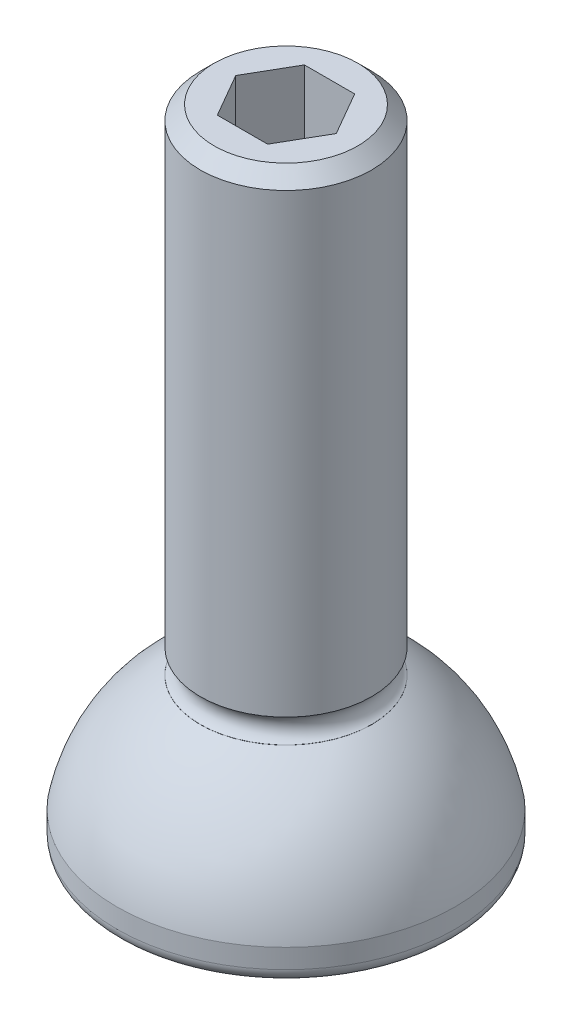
ISO-10303-21;
HEADER;
FILE_DESCRIPTION(('STEP AP214'),'2;1');
FILE_NAME('part.step','',(''),(''),'','','');
FILE_SCHEMA(('AUTOMOTIVE_DESIGN { 1 0 10303 214 1 1 1 1 }'));
ENDSEC;
DATA;
#1=APPLICATION_CONTEXT('core data for automotive mechanical design processes');
#2=APPLICATION_PROTOCOL_DEFINITION('international standard','automotive_design',2000,#1);
#3=PRODUCT_CONTEXT('',#1,'mechanical');
#4=PRODUCT('Part','Part','',(#3));
#5=PRODUCT_RELATED_PRODUCT_CATEGORY('part','',(#4));
#6=PRODUCT_DEFINITION_FORMATION('','',#4);
#7=PRODUCT_DEFINITION_CONTEXT('part definition',#1,'design');
#8=PRODUCT_DEFINITION('design','',#6,#7);
#9=PRODUCT_DEFINITION_SHAPE('','',#8);
#10=(LENGTH_UNIT() NAMED_UNIT(*) SI_UNIT(.MILLI.,.METRE.));
#11=(NAMED_UNIT(*) PLANE_ANGLE_UNIT() SI_UNIT($,.RADIAN.));
#12=(NAMED_UNIT(*) SI_UNIT($,.STERADIAN.) SOLID_ANGLE_UNIT());
#13=UNCERTAINTY_MEASURE_WITH_UNIT(LENGTH_MEASURE(1.E-05),#10,'distance_accuracy_value','');
#14=(GEOMETRIC_REPRESENTATION_CONTEXT(3) GLOBAL_UNCERTAINTY_ASSIGNED_CONTEXT((#13)) GLOBAL_UNIT_ASSIGNED_CONTEXT((#10,
#11,#12)) REPRESENTATION_CONTEXT('',''));
#15=CARTESIAN_POINT('',(0.,0.,0.));
#16=DIRECTION('',(0.,0.,1.));
#17=DIRECTION('',(1.,0.,0.));
#18=AXIS2_PLACEMENT_3D('',#15,#16,#17);
#19=CARTESIAN_POINT('',(3.49148336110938E-12,-1000.,0.));
#20=DIRECTION('',(0.,-1.,0.));
#21=DIRECTION('',(1.,0.,0.));
#22=AXIS2_PLACEMENT_3D('',#19,#20,#21);
#23=CYLINDRICAL_SURFACE('',#22,4.69900000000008);
#24=CARTESIAN_POINT('',(0.,9.52451135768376,0.));
#25=DIRECTION('',(0.,-1.,0.));
#26=DIRECTION('',(1.,0.,0.));
#27=AXIS2_PLACEMENT_3D('',#24,#25,#26);
#28=CIRCLE('',#27,4.69900000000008);
#29=CARTESIAN_POINT('',(4.69900000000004,9.52451135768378,0.));
#30=VERTEX_POINT('',#29);
#31=EDGE_CURVE('E194',#30,#30,#28,.T.);
#32=ORIENTED_EDGE('',*,*,#31,.F.);
#33=EDGE_LOOP('',(#32));
#34=FACE_BOUND('',#33,.T.);
#35=CARTESIAN_POINT('',(-1.20609801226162E-13,34.5439999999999,0.));
#36=DIRECTION('',(0.,1.,0.));
#37=DIRECTION('',(-1.,0.,0.));
#38=AXIS2_PLACEMENT_3D('',#35,#36,#37);
#39=CIRCLE('',#38,4.69900000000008);
#40=CARTESIAN_POINT('',(-4.6990000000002,34.5439999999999,0.));
#41=VERTEX_POINT('',#40);
#42=EDGE_CURVE('E182',#41,#41,#39,.F.);
#43=ORIENTED_EDGE('',*,*,#42,.T.);
#44=EDGE_LOOP('',(#43));
#45=FACE_BOUND('',#44,.T.);
#46=ADVANCED_FACE('F32',(#34,#45),#23,.T.);
#47=CARTESIAN_POINT('',(4.699,35.306,0.));
#48=DIRECTION('',(0.,1.,0.));
#49=DIRECTION('',(-1.,0.,0.));
#50=AXIS2_PLACEMENT_3D('',#47,#48,#49);
#51=PLANE('',#50);
#52=DIRECTION('',(1.,0.,0.));
#53=VECTOR('',#52,1.);
#54=CARTESIAN_POINT('',(-1.37848150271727,35.306,2.3876));
#55=LINE('',#54,#53);
#56=CARTESIAN_POINT('',(-1.37848150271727,35.306,2.3876));
#57=VERTEX_POINT('',#56);
#58=CARTESIAN_POINT('',(1.37848150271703,35.306,2.3876));
#59=VERTEX_POINT('',#58);
#60=EDGE_CURVE('E155',#57,#59,#55,.T.);
#61=ORIENTED_EDGE('',*,*,#60,.F.);
#62=DIRECTION('',(0.5,0.,0.866025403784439));
#63=VECTOR('',#62,1.);
#64=CARTESIAN_POINT('',(-2.75696300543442,35.306,0.));
#65=LINE('',#64,#63);
#66=CARTESIAN_POINT('',(-2.75696300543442,35.306,0.));
#67=VERTEX_POINT('',#66);
#68=EDGE_CURVE('E152',#67,#57,#65,.T.);
#69=ORIENTED_EDGE('',*,*,#68,.F.);
#70=DIRECTION('',(-0.5,0.,0.866025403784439));
#71=VECTOR('',#70,1.);
#72=CARTESIAN_POINT('',(-1.37848150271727,35.306,-2.3876));
#73=LINE('',#72,#71);
#74=CARTESIAN_POINT('',(-1.37848150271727,35.306,-2.3876));
#75=VERTEX_POINT('',#74);
#76=EDGE_CURVE('E149',#75,#67,#73,.T.);
#77=ORIENTED_EDGE('',*,*,#76,.F.);
#78=DIRECTION('',(-1.,0.,0.));
#79=VECTOR('',#78,1.);
#80=CARTESIAN_POINT('',(1.37848150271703,35.306,-2.3876));
#81=LINE('',#80,#79);
#82=CARTESIAN_POINT('',(1.37848150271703,35.306,-2.3876));
#83=VERTEX_POINT('',#82);
#84=EDGE_CURVE('E147',#83,#75,#81,.T.);
#85=ORIENTED_EDGE('',*,*,#84,.F.);
#86=DIRECTION('',(-0.5,0.,-0.866025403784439));
#87=VECTOR('',#86,1.);
#88=CARTESIAN_POINT('',(2.75696300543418,35.306,0.));
#89=LINE('',#88,#87);
#90=CARTESIAN_POINT('',(2.75696300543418,35.306,0.));
#91=VERTEX_POINT('',#90);
#92=EDGE_CURVE('E122',#91,#83,#89,.T.);
#93=ORIENTED_EDGE('',*,*,#92,.F.);
#94=DIRECTION('',(0.5,0.,-0.866025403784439));
#95=VECTOR('',#94,1.);
#96=CARTESIAN_POINT('',(1.37848150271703,35.306,2.3876));
#97=LINE('',#96,#95);
#98=EDGE_CURVE('E115',#59,#91,#97,.T.);
#99=ORIENTED_EDGE('',*,*,#98,.F.);
#100=EDGE_LOOP('',(#61,#69,#77,#85,#93,#99));
#101=FACE_BOUND('',#100,.T.);
#102=CARTESIAN_POINT('',(-1.23270311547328E-13,35.306,0.));
#103=DIRECTION('',(0.,1.,0.));
#104=DIRECTION('',(-1.,0.,0.));
#105=AXIS2_PLACEMENT_3D('',#102,#103,#104);
#106=CIRCLE('',#105,3.9370000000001);
#107=CARTESIAN_POINT('',(-3.93700000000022,35.306,0.));
#108=VERTEX_POINT('',#107);
#109=EDGE_CURVE('E185',#108,#108,#106,.T.);
#110=ORIENTED_EDGE('',*,*,#109,.T.);
#111=EDGE_LOOP('',(#110));
#112=FACE_BOUND('',#111,.T.);
#113=ADVANCED_FACE('F226',(#101,#112),#51,.T.);
#114=CARTESIAN_POINT('',(-1.20609801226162E-13,34.5439999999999,0.));
#115=DIRECTION('',(0.,-1.,0.));
#116=DIRECTION('',(1.,0.,0.));
#117=AXIS2_PLACEMENT_3D('',#114,#115,#116);
#118=CONICAL_SURFACE('',#117,4.69900000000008,0.785398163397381);
#119=ORIENTED_EDGE('',*,*,#109,.F.);
#120=EDGE_LOOP('',(#119));
#121=FACE_BOUND('',#120,.T.);
#122=ORIENTED_EDGE('',*,*,#42,.F.);
#123=EDGE_LOOP('',(#122));
#124=FACE_BOUND('',#123,.T.);
#125=ADVANCED_FACE('F231',(#121,#124),#118,.T.);
#126=CARTESIAN_POINT('',(2.7569630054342,30.48,0.));
#127=DIRECTION('',(0.866025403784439,0.,-0.5));
#128=DIRECTION('',(-0.5,0.,-0.866025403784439));
#129=AXIS2_PLACEMENT_3D('',#126,#127,#128);
#130=PLANE('',#129);
#131=ORIENTED_EDGE('',*,*,#92,.T.);
#132=DIRECTION('',(0.,1.,0.));
#133=VECTOR('',#132,1.);
#134=CARTESIAN_POINT('',(1.37848150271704,30.48,-2.3876));
#135=LINE('',#134,#133);
#136=CARTESIAN_POINT('',(1.37848150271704,30.48,-2.3876));
#137=VERTEX_POINT('',#136);
#138=EDGE_CURVE('E119',#137,#83,#135,.T.);
#139=ORIENTED_EDGE('',*,*,#138,.F.);
#140=DIRECTION('',(-0.5,0.,-0.866025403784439));
#141=VECTOR('',#140,1.);
#142=CARTESIAN_POINT('',(2.7569630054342,30.48,0.));
#143=LINE('',#142,#141);
#144=CARTESIAN_POINT('',(2.06772225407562,30.48,-1.19380000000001));
#145=VERTEX_POINT('',#144);
#146=EDGE_CURVE('E105',#145,#137,#143,.T.);
#147=ORIENTED_EDGE('',*,*,#146,.F.);
#148=CARTESIAN_POINT('',(2.7569630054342,30.48,0.));
#149=VERTEX_POINT('',#148);
#150=EDGE_CURVE('E114',#149,#145,#143,.T.);
#151=ORIENTED_EDGE('',*,*,#150,.F.);
#152=DIRECTION('',(0.,1.,0.));
#153=VECTOR('',#152,1.);
#154=CARTESIAN_POINT('',(2.7569630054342,30.48,0.));
#155=LINE('',#154,#153);
#156=EDGE_CURVE('E160',#149,#91,#155,.T.);
#157=ORIENTED_EDGE('',*,*,#156,.T.);
#158=EDGE_LOOP('',(#131,#139,#147,#151,#157));
#159=FACE_BOUND('',#158,.T.);
#160=ADVANCED_FACE('F120',(#159),#130,.F.);
#161=CARTESIAN_POINT('',(1.37848150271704,30.48,2.3876));
#162=DIRECTION('',(0.866025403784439,0.,0.5));
#163=DIRECTION('',(0.5,0.,-0.866025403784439));
#164=AXIS2_PLACEMENT_3D('',#161,#162,#163);
#165=PLANE('',#164);
#166=ORIENTED_EDGE('',*,*,#98,.T.);
#167=ORIENTED_EDGE('',*,*,#156,.F.);
#168=DIRECTION('',(0.5,0.,-0.866025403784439));
#169=VECTOR('',#168,1.);
#170=CARTESIAN_POINT('',(1.37848150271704,30.48,2.3876));
#171=LINE('',#170,#169);
#172=CARTESIAN_POINT('',(2.06772225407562,30.48,1.19380000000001));
#173=VERTEX_POINT('',#172);
#174=EDGE_CURVE('E143',#173,#149,#171,.T.);
#175=ORIENTED_EDGE('',*,*,#174,.F.);
#176=CARTESIAN_POINT('',(1.37848150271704,30.48,2.3876));
#177=VERTEX_POINT('',#176);
#178=EDGE_CURVE('E125',#177,#173,#171,.T.);
#179=ORIENTED_EDGE('',*,*,#178,.F.);
#180=DIRECTION('',(0.,1.,0.));
#181=VECTOR('',#180,1.);
#182=CARTESIAN_POINT('',(1.37848150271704,30.48,2.3876));
#183=LINE('',#182,#181);
#184=EDGE_CURVE('E163',#177,#59,#183,.T.);
#185=ORIENTED_EDGE('',*,*,#184,.T.);
#186=EDGE_LOOP('',(#166,#167,#175,#179,#185));
#187=FACE_BOUND('',#186,.T.);
#188=ADVANCED_FACE('F246',(#187),#165,.F.);
#189=CARTESIAN_POINT('',(-1.37848150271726,30.48,2.3876));
#190=DIRECTION('',(0.,0.,1.));
#191=DIRECTION('',(1.,0.,0.));
#192=AXIS2_PLACEMENT_3D('',#189,#190,#191);
#193=PLANE('',#192);
#194=ORIENTED_EDGE('',*,*,#60,.T.);
#195=ORIENTED_EDGE('',*,*,#184,.F.);
#196=DIRECTION('',(1.,0.,0.));
#197=VECTOR('',#196,1.);
#198=CARTESIAN_POINT('',(-1.37848150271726,30.48,2.3876));
#199=LINE('',#198,#197);
#200=CARTESIAN_POINT('',(-1.20609801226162E-13,30.48,2.3876));
#201=VERTEX_POINT('',#200);
#202=EDGE_CURVE('E139',#201,#177,#199,.T.);
#203=ORIENTED_EDGE('',*,*,#202,.F.);
#204=CARTESIAN_POINT('',(-1.37848150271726,30.48,2.3876));
#205=VERTEX_POINT('',#204);
#206=EDGE_CURVE('E140',#205,#201,#199,.T.);
#207=ORIENTED_EDGE('',*,*,#206,.F.);
#208=DIRECTION('',(0.,1.,0.));
#209=VECTOR('',#208,1.);
#210=CARTESIAN_POINT('',(-1.37848150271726,30.48,2.3876));
#211=LINE('',#210,#209);
#212=EDGE_CURVE('E166',#205,#57,#211,.T.);
#213=ORIENTED_EDGE('',*,*,#212,.T.);
#214=EDGE_LOOP('',(#194,#195,#203,#207,#213));
#215=FACE_BOUND('',#214,.T.);
#216=ADVANCED_FACE('F257',(#215),#193,.F.);
#217=CARTESIAN_POINT('',(-2.75696300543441,30.48,0.));
#218=DIRECTION('',(-0.866025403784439,0.,0.5));
#219=DIRECTION('',(0.5,0.,0.866025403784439));
#220=AXIS2_PLACEMENT_3D('',#217,#218,#219);
#221=PLANE('',#220);
#222=ORIENTED_EDGE('',*,*,#68,.T.);
#223=ORIENTED_EDGE('',*,*,#212,.F.);
#224=DIRECTION('',(0.5,0.,0.866025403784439));
#225=VECTOR('',#224,1.);
#226=CARTESIAN_POINT('',(-2.75696300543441,30.48,0.));
#227=LINE('',#226,#225);
#228=CARTESIAN_POINT('',(-2.06772225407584,30.48,1.19379999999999));
#229=VERTEX_POINT('',#228);
#230=EDGE_CURVE('E137',#229,#205,#227,.T.);
#231=ORIENTED_EDGE('',*,*,#230,.F.);
#232=CARTESIAN_POINT('',(-2.75696300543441,30.48,0.));
#233=VERTEX_POINT('',#232);
#234=EDGE_CURVE('E50',#233,#229,#227,.T.);
#235=ORIENTED_EDGE('',*,*,#234,.F.);
#236=DIRECTION('',(0.,1.,0.));
#237=VECTOR('',#236,1.);
#238=CARTESIAN_POINT('',(-2.75696300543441,30.48,0.));
#239=LINE('',#238,#237);
#240=EDGE_CURVE('E169',#233,#67,#239,.T.);
#241=ORIENTED_EDGE('',*,*,#240,.T.);
#242=EDGE_LOOP('',(#222,#223,#231,#235,#241));
#243=FACE_BOUND('',#242,.T.);
#244=ADVANCED_FACE('F253',(#243),#221,.F.);
#245=CARTESIAN_POINT('',(-1.37848150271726,30.48,-2.3876));
#246=DIRECTION('',(-0.866025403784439,0.,-0.5));
#247=DIRECTION('',(-0.5,0.,0.866025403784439));
#248=AXIS2_PLACEMENT_3D('',#245,#246,#247);
#249=PLANE('',#248);
#250=ORIENTED_EDGE('',*,*,#76,.T.);
#251=ORIENTED_EDGE('',*,*,#240,.F.);
#252=DIRECTION('',(-0.5,0.,0.866025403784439));
#253=VECTOR('',#252,1.);
#254=CARTESIAN_POINT('',(-1.37848150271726,30.48,-2.3876));
#255=LINE('',#254,#253);
#256=CARTESIAN_POINT('',(-2.06772225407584,30.48,-1.19379999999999));
#257=VERTEX_POINT('',#256);
#258=EDGE_CURVE('E131',#257,#233,#255,.T.);
#259=ORIENTED_EDGE('',*,*,#258,.F.);
#260=CARTESIAN_POINT('',(-1.37848150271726,30.48,-2.3876));
#261=VERTEX_POINT('',#260);
#262=EDGE_CURVE('E133',#261,#257,#255,.T.);
#263=ORIENTED_EDGE('',*,*,#262,.F.);
#264=DIRECTION('',(0.,1.,0.));
#265=VECTOR('',#264,1.);
#266=CARTESIAN_POINT('',(-1.37848150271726,30.48,-2.3876));
#267=LINE('',#266,#265);
#268=EDGE_CURVE('E124',#261,#75,#267,.T.);
#269=ORIENTED_EDGE('',*,*,#268,.T.);
#270=EDGE_LOOP('',(#250,#251,#259,#263,#269));
#271=FACE_BOUND('',#270,.T.);
#272=ADVANCED_FACE('F250',(#271),#249,.F.);
#273=CARTESIAN_POINT('',(1.37848150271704,30.48,-2.3876));
#274=DIRECTION('',(0.,0.,-1.));
#275=DIRECTION('',(-1.,0.,0.));
#276=AXIS2_PLACEMENT_3D('',#273,#274,#275);
#277=PLANE('',#276);
#278=ORIENTED_EDGE('',*,*,#84,.T.);
#279=ORIENTED_EDGE('',*,*,#268,.F.);
#280=DIRECTION('',(-1.,0.,0.));
#281=VECTOR('',#280,1.);
#282=CARTESIAN_POINT('',(1.37848150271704,30.48,-2.3876));
#283=LINE('',#282,#281);
#284=CARTESIAN_POINT('',(-1.21360958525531E-13,30.48,-2.3876));
#285=VERTEX_POINT('',#284);
#286=EDGE_CURVE('E130',#285,#261,#283,.T.);
#287=ORIENTED_EDGE('',*,*,#286,.F.);
#288=EDGE_CURVE('E109',#137,#285,#283,.T.);
#289=ORIENTED_EDGE('',*,*,#288,.F.);
#290=ORIENTED_EDGE('',*,*,#138,.T.);
#291=EDGE_LOOP('',(#278,#279,#287,#289,#290));
#292=FACE_BOUND('',#291,.T.);
#293=ADVANCED_FACE('F128',(#292),#277,.F.);
#294=CARTESIAN_POINT('',(1.37848150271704,30.48,-2.3876));
#295=DIRECTION('',(0.,1.,0.));
#296=DIRECTION('',(-1.,0.,0.));
#297=AXIS2_PLACEMENT_3D('',#294,#295,#296);
#298=PLANE('',#297);
#299=CARTESIAN_POINT('',(-1.20609801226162E-13,30.48,0.));
#300=DIRECTION('',(0.,1.,0.));
#301=DIRECTION('',(-1.,0.,0.));
#302=AXIS2_PLACEMENT_3D('',#299,#300,#301);
#303=CIRCLE('',#302,2.3876);
#304=EDGE_CURVE('E11',#257,#285,#303,.F.);
#305=ORIENTED_EDGE('',*,*,#304,.T.);
#306=ORIENTED_EDGE('',*,*,#286,.T.);
#307=ORIENTED_EDGE('',*,*,#262,.T.);
#308=EDGE_LOOP('',(#305,#306,#307));
#309=FACE_BOUND('',#308,.T.);
#310=ADVANCED_FACE('F249',(#309),#298,.T.);
#311=EDGE_CURVE('E41',#285,#145,#303,.F.);
#312=ORIENTED_EDGE('',*,*,#311,.T.);
#313=ORIENTED_EDGE('',*,*,#146,.T.);
#314=ORIENTED_EDGE('',*,*,#288,.T.);
#315=EDGE_LOOP('',(#312,#313,#314));
#316=FACE_BOUND('',#315,.T.);
#317=ADVANCED_FACE('F107',(#316),#298,.T.);
#318=EDGE_CURVE('E431',#145,#173,#303,.F.);
#319=ORIENTED_EDGE('',*,*,#318,.T.);
#320=ORIENTED_EDGE('',*,*,#174,.T.);
#321=ORIENTED_EDGE('',*,*,#150,.T.);
#322=EDGE_LOOP('',(#319,#320,#321));
#323=FACE_BOUND('',#322,.T.);
#324=ADVANCED_FACE('F320',(#323),#298,.T.);
#325=EDGE_CURVE('E432',#173,#201,#303,.F.);
#326=ORIENTED_EDGE('',*,*,#325,.T.);
#327=ORIENTED_EDGE('',*,*,#202,.T.);
#328=ORIENTED_EDGE('',*,*,#178,.T.);
#329=EDGE_LOOP('',(#326,#327,#328));
#330=FACE_BOUND('',#329,.T.);
#331=ADVANCED_FACE('F326',(#330),#298,.T.);
#332=EDGE_CURVE('E193',#201,#229,#303,.F.);
#333=ORIENTED_EDGE('',*,*,#332,.T.);
#334=ORIENTED_EDGE('',*,*,#230,.T.);
#335=ORIENTED_EDGE('',*,*,#206,.T.);
#336=EDGE_LOOP('',(#333,#334,#335));
#337=FACE_BOUND('',#336,.T.);
#338=ADVANCED_FACE('F333',(#337),#298,.T.);
#339=EDGE_CURVE('E43',#229,#257,#303,.F.);
#340=ORIENTED_EDGE('',*,*,#339,.T.);
#341=ORIENTED_EDGE('',*,*,#258,.T.);
#342=ORIENTED_EDGE('',*,*,#234,.T.);
#343=EDGE_LOOP('',(#340,#341,#342));
#344=FACE_BOUND('',#343,.T.);
#345=ADVANCED_FACE('F240',(#344),#298,.T.);
#346=CARTESIAN_POINT('',(-1.20609801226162E-13,28.956,0.));
#347=DIRECTION('',(0.,1.,0.));
#348=DIRECTION('',(0.,0.,1.));
#349=AXIS2_PLACEMENT_3D('',#346,#347,#348);
#350=CONICAL_SURFACE('',#349,2.3876,1.02974425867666);
#351=CARTESIAN_POINT('',(-1.20597417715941E-13,27.5213851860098,0.));
#352=VERTEX_POINT('',#351);
#353=VERTEX_LOOP('',#352);
#354=FACE_BOUND('',#353,.T.);
#355=CARTESIAN_POINT('',(-1.20609801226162E-13,28.956,0.));
#356=DIRECTION('',(0.,1.,0.));
#357=DIRECTION('',(0.,0.,1.));
#358=AXIS2_PLACEMENT_3D('',#355,#356,#357);
#359=CIRCLE('',#358,2.3876);
#360=CARTESIAN_POINT('',(-1.20609801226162E-13,28.956,2.3876));
#361=VERTEX_POINT('',#360);
#362=EDGE_CURVE('E162',#361,#361,#359,.T.);
#363=ORIENTED_EDGE('',*,*,#362,.T.);
#364=EDGE_LOOP('',(#363));
#365=FACE_BOUND('',#364,.T.);
#366=ADVANCED_FACE('F236',(#354,#365),#350,.F.);
#367=CARTESIAN_POINT('',(-1.20609801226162E-13,35.306,0.));
#368=DIRECTION('',(0.,1.,0.));
#369=DIRECTION('',(0.,0.,1.));
#370=AXIS2_PLACEMENT_3D('',#367,#368,#369);
#371=CYLINDRICAL_SURFACE('',#370,2.3876);
#372=ORIENTED_EDGE('',*,*,#362,.F.);
#373=EDGE_LOOP('',(#372));
#374=FACE_BOUND('',#373,.T.);
#375=ORIENTED_EDGE('',*,*,#304,.F.);
#376=ORIENTED_EDGE('',*,*,#339,.F.);
#377=ORIENTED_EDGE('',*,*,#332,.F.);
#378=ORIENTED_EDGE('',*,*,#325,.F.);
#379=ORIENTED_EDGE('',*,*,#318,.F.);
#380=ORIENTED_EDGE('',*,*,#311,.F.);
#381=EDGE_LOOP('',(#375,#376,#377,#378,#379,#380));
#382=FACE_BOUND('',#381,.T.);
#383=ADVANCED_FACE('F239',(#374,#382),#371,.F.);
#384=CARTESIAN_POINT('',(0.,8.8646,0.));
#385=DIRECTION('',(0.,-1.,0.));
#386=DIRECTION('',(1.,0.,0.));
#387=AXIS2_PLACEMENT_3D('',#384,#385,#386);
#388=TOROIDAL_SURFACE('',#387,5.08000000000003,0.761999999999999);
#389=CARTESIAN_POINT('',(0.,8.20468864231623,0.));
#390=DIRECTION('',(0.,1.,0.));
#391=DIRECTION('',(-1.,0.,0.));
#392=AXIS2_PLACEMENT_3D('',#389,#390,#391);
#393=CIRCLE('',#392,4.69900000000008);
#394=CARTESIAN_POINT('',(-4.6990000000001,8.20468864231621,0.));
#395=VERTEX_POINT('',#394);
#396=EDGE_CURVE('E36',#395,#395,#393,.T.);
#397=ORIENTED_EDGE('',*,*,#396,.T.);
#398=EDGE_LOOP('',(#397));
#399=FACE_BOUND('',#398,.T.);
#400=ORIENTED_EDGE('',*,*,#31,.T.);
#401=EDGE_LOOP('',(#400));
#402=FACE_BOUND('',#401,.T.);
#403=ADVANCED_FACE('F201',(#399,#402),#388,.F.);
#404=CARTESIAN_POINT('',(0.,0.,0.));
#405=DIRECTION('',(0.,-1.,0.));
#406=DIRECTION('',(1.,0.,0.));
#407=AXIS2_PLACEMENT_3D('',#404,#405,#406);
#408=PLANE('',#407);
#409=CARTESIAN_POINT('',(0.,0.,0.));
#410=DIRECTION('',(0.,-1.,0.));
#411=DIRECTION('',(1.,0.,0.));
#412=AXIS2_PLACEMENT_3D('',#409,#410,#411);
#413=CIRCLE('',#412,8.509);
#414=CARTESIAN_POINT('',(8.509,0.,0.));
#415=VERTEX_POINT('',#414);
#416=EDGE_CURVE('E188',#415,#415,#413,.T.);
#417=ORIENTED_EDGE('',*,*,#416,.T.);
#418=EDGE_LOOP('',(#417));
#419=FACE_BOUND('',#418,.T.);
#420=ADVANCED_FACE('F222',(#419),#408,.T.);
#421=CARTESIAN_POINT('',(0.,0.761999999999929,0.));
#422=DIRECTION('',(0.,-1.,0.));
#423=DIRECTION('',(1.,0.,0.));
#424=AXIS2_PLACEMENT_3D('',#421,#422,#423);
#425=TOROIDAL_SURFACE('',#424,8.509,0.762);
#426=CARTESIAN_POINT('',(0.,0.761999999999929,0.));
#427=DIRECTION('',(0.,-1.,0.));
#428=DIRECTION('',(1.,0.,0.));
#429=AXIS2_PLACEMENT_3D('',#426,#427,#428);
#430=CIRCLE('',#429,9.271);
#431=CARTESIAN_POINT('',(9.271,0.761999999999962,0.));
#432=VERTEX_POINT('',#431);
#433=EDGE_CURVE('E191',#432,#432,#430,.F.);
#434=ORIENTED_EDGE('',*,*,#433,.F.);
#435=EDGE_LOOP('',(#434));
#436=FACE_BOUND('',#435,.T.);
#437=ORIENTED_EDGE('',*,*,#416,.F.);
#438=EDGE_LOOP('',(#437));
#439=FACE_BOUND('',#438,.T.);
#440=ADVANCED_FACE('F34',(#436,#439),#425,.T.);
#441=CARTESIAN_POINT('',(3.49148336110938E-12,-1000.,0.));
#442=DIRECTION('',(0.,-1.,0.));
#443=DIRECTION('',(1.,0.,0.));
#444=AXIS2_PLACEMENT_3D('',#441,#442,#443);
#445=CYLINDRICAL_SURFACE('',#444,9.271);
#446=ORIENTED_EDGE('',*,*,#433,.T.);
#447=EDGE_LOOP('',(#446));
#448=FACE_BOUND('',#447,.T.);
#449=CARTESIAN_POINT('',(0.,1.82438494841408,0.));
#450=DIRECTION('',(0.,-1.,0.));
#451=DIRECTION('',(1.,0.,0.));
#452=AXIS2_PLACEMENT_3D('',#449,#450,#451);
#453=CIRCLE('',#452,9.271);
#454=CARTESIAN_POINT('',(9.271,1.82438494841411,0.));
#455=VERTEX_POINT('',#454);
#456=EDGE_CURVE('E179',#455,#455,#453,.T.);
#457=ORIENTED_EDGE('',*,*,#456,.T.);
#458=EDGE_LOOP('',(#457));
#459=FACE_BOUND('',#458,.T.);
#460=ADVANCED_FACE('F212',(#448,#459),#445,.T.);
#461=CARTESIAN_POINT('',(0.,0.,0.));
#462=DIRECTION('',(0.,-1.,0.));
#463=DIRECTION('',(1.,0.,0.));
#464=AXIS2_PLACEMENT_3D('',#461,#462,#463);
#465=SPHERICAL_SURFACE('',#464,9.4488);
#466=CARTESIAN_POINT('',(0.,8.19751306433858,0.));
#467=DIRECTION('',(0.,-1.,0.));
#468=DIRECTION('',(1.,0.,0.));
#469=AXIS2_PLACEMENT_3D('',#466,#467,#468);
#470=CIRCLE('',#469,4.69900000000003);
#471=CARTESIAN_POINT('',(4.69899999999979,8.1975130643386,0.));
#472=VERTEX_POINT('',#471);
#473=EDGE_CURVE('E176',#472,#472,#470,.T.);
#474=CARTESIAN_POINT('',(4.69899999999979,8.1975130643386,0.));
#475=CARTESIAN_POINT('',(4.77209442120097,8.15561402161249,0.));
#476=CARTESIAN_POINT('',(4.84462814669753,8.11273685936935,0.));
#477=CARTESIAN_POINT('',(4.98852296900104,8.025058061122,0.));
#478=CARTESIAN_POINT('',(5.05988406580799,7.98025642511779,0.));
#479=CARTESIAN_POINT('',(5.20138239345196,7.88876044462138,0.));
#480=CARTESIAN_POINT('',(5.27151962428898,7.84206610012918,0.));
#481=CARTESIAN_POINT('',(5.4105200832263,7.74681819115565,0.));
#482=CARTESIAN_POINT('',(5.4793833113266,7.69826462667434,0.));
#483=CARTESIAN_POINT('',(5.61578647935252,7.59933299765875,0.));
#484=CARTESIAN_POINT('',(5.68332641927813,7.54895493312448,0.));
#485=CARTESIAN_POINT('',(5.81703468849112,7.44641035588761,0.));
#486=CARTESIAN_POINT('',(5.8832030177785,7.39424384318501,0.));
#487=CARTESIAN_POINT('',(6.01412072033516,7.28815969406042,0.));
#488=CARTESIAN_POINT('',(6.07887009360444,7.23424205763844,0.));
#489=CARTESIAN_POINT('',(6.20690355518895,7.12469424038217,0.));
#490=CARTESIAN_POINT('',(6.27018764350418,7.06906405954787,0.));
#491=CARTESIAN_POINT('',(6.39524525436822,6.95613095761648,0.));
#492=CARTESIAN_POINT('',(6.45701877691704,6.89882803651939,0.));
#493=CARTESIAN_POINT('',(6.57901105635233,6.7825904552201,0.));
#494=CARTESIAN_POINT('',(6.63922981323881,6.7236557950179,0.));
#495=CARTESIAN_POINT('',(6.75806947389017,6.60419690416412,0.));
#496=CARTESIAN_POINT('',(6.81669037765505,6.54367267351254,0.));
#497=CARTESIAN_POINT('',(6.93229238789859,6.42107794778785,0.));
#498=CARTESIAN_POINT('',(6.98927349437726,6.35900745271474,0.));
#499=CARTESIAN_POINT('',(7.10155513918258,6.23336461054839,0.));
#500=CARTESIAN_POINT('',(7.15685567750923,6.16979226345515,0.));
#501=CARTESIAN_POINT('',(7.2657366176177,6.04119120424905,0.));
#502=CARTESIAN_POINT('',(7.31931701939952,5.97616249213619,0.));
#503=CARTESIAN_POINT('',(7.42471934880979,5.84469523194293,0.));
#504=CARTESIAN_POINT('',(7.47654127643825,5.77825668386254,0.));
#505=CARTESIAN_POINT('',(7.5783895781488,5.64401728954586,0.));
#506=CARTESIAN_POINT('',(7.6284159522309,5.57621644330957,0.));
#507=CARTESIAN_POINT('',(7.72663735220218,5.43930096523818,0.));
#508=CARTESIAN_POINT('',(7.77483237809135,5.37018633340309,0.));
#509=CARTESIAN_POINT('',(7.86935659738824,5.23069273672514,0.));
#510=CARTESIAN_POINT('',(7.91568579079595,5.1603137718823,0.));
#511=CARTESIAN_POINT('',(8.00644519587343,5.0183418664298,0.));
#512=CARTESIAN_POINT('',(8.05087540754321,4.94674892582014,0.));
#513=CARTESIAN_POINT('',(8.1378050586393,4.80240029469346,0.));
#514=CARTESIAN_POINT('',(8.18030449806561,4.72964460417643,0.));
#515=CARTESIAN_POINT('',(8.26334219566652,4.58302253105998,0.));
#516=CARTESIAN_POINT('',(8.30388045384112,4.50915614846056,0.));
#517=CARTESIAN_POINT('',(8.38296678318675,4.3603655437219,0.));
#518=CARTESIAN_POINT('',(8.42151485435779,4.28544132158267,0.));
#519=CARTESIAN_POINT('',(8.49659322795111,4.13458864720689,0.));
#520=CARTESIAN_POINT('',(8.53312353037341,4.05866019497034,0.));
#521=CARTESIAN_POINT('',(8.60414022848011,3.90585338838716,0.));
#522=CARTESIAN_POINT('',(8.63862662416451,3.82897503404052,0.));
#523=CARTESIAN_POINT('',(8.70553083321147,3.67432343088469,0.));
#524=CARTESIAN_POINT('',(8.73794864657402,3.59655018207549,0.));
#525=CARTESIAN_POINT('',(8.80069249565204,3.44016443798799,0.));
#526=CARTESIAN_POINT('',(8.83101853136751,3.36155194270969,0.));
#527=CARTESIAN_POINT('',(8.88955712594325,3.20354395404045,0.));
#528=CARTESIAN_POINT('',(8.91776968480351,3.12414846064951,0.));
#529=CARTESIAN_POINT('',(8.97206114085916,2.96463128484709,0.));
#530=CARTESIAN_POINT('',(8.99814003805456,2.88450960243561,0.));
#531=CARTESIAN_POINT('',(9.04814550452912,2.72359737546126,0.));
#532=CARTESIAN_POINT('',(9.07207207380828,2.64280683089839,0.));
#533=CARTESIAN_POINT('',(9.11775578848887,2.48061469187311,0.));
#534=CARTESIAN_POINT('',(9.1395129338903,2.39921309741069,0.));
#535=CARTESIAN_POINT('',(9.18084214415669,2.23585708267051,0.));
#536=CARTESIAN_POINT('',(9.20041420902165,2.15390266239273,0.));
#537=CARTESIAN_POINT('',(9.23735958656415,1.98949971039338,0.));
#538=CARTESIAN_POINT('',(9.25473289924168,1.90705117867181,0.));
#539=CARTESIAN_POINT('',(9.271,1.82438494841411,0.));
#540=B_SPLINE_CURVE_WITH_KNOTS('',3,(#474,#475,#476,#477,#478,#479,#480,#481,#482,#483,#484,
#485,#486,#487,#488,#489,#490,#491,#492,#493,#494,#495,#496,#497,#498,#499,#500,#501,#502,#503,
#504,#505,#506,#507,#508,#509,#510,#511,#512,#513,#514,#515,#516,#517,#518,#519,#520,#521,#522,
#523,#524,#525,#526,#527,#528,#529,#530,#531,#532,#533,#534,#535,#536,#537,#538,#539),
.UNSPECIFIED.,.F.,.F.,(4,2,2,2,2,2,2,2,2,2,2,2,2,2,2,2,2,2,2,2,2,2,2,2,2,2,2,2,2,2,2,2,4),(0.,
0.252747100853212,0.505494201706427,0.758241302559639,1.01098840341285,1.26373550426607,
1.51648260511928,1.76922970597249,2.0219768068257,2.27472390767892,2.52747100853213,
2.78021810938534,3.03296521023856,3.28571231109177,3.53845941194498,3.79120651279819,
4.04395361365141,4.29670071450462,4.54944781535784,4.80219491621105,5.05494201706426,
5.30768911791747,5.56043621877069,5.8131833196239,6.06593042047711,6.31867752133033,
6.57142462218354,6.82417172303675,7.07691882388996,7.32966592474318,7.58241302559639,
7.8351601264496,8.08790722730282),.UNSPECIFIED.);
#541=EDGE_CURVE('BSEAM206',#472,#455,#540,.T.);
#542=ORIENTED_EDGE('',*,*,#473,.T.);
#543=ORIENTED_EDGE('',*,*,#456,.F.);
#544=ORIENTED_EDGE('',*,*,#541,.T.);
#545=ORIENTED_EDGE('',*,*,#541,.F.);
#546=EDGE_LOOP('',(#542,#544,#543,#545));
#547=FACE_BOUND('',#546,.T.);
#548=ADVANCED_FACE('F206',(#547),#465,.T.);
#549=ORIENTED_EDGE('',*,*,#396,.F.);
#550=EDGE_LOOP('',(#549));
#551=FACE_BOUND('',#550,.T.);
#552=ORIENTED_EDGE('',*,*,#473,.F.);
#553=EDGE_LOOP('',(#552));
#554=FACE_BOUND('',#553,.T.);
#555=ADVANCED_FACE('F203',(#551,#554),#23,.T.);
#556=CLOSED_SHELL('',(#46,#113,#125,#160,#188,#216,#244,#272,#293,#310,#317,#324,#331,#338,#345,
#366,#383,#403,#420,#440,#460,#548,#555));
#557=MANIFOLD_SOLID_BREP('B2',#556);
#558=ADVANCED_BREP_SHAPE_REPRESENTATION('',(#18,#557),#14);
#559=SHAPE_DEFINITION_REPRESENTATION(#9,#558);
ENDSEC;
END-ISO-10303-21;
